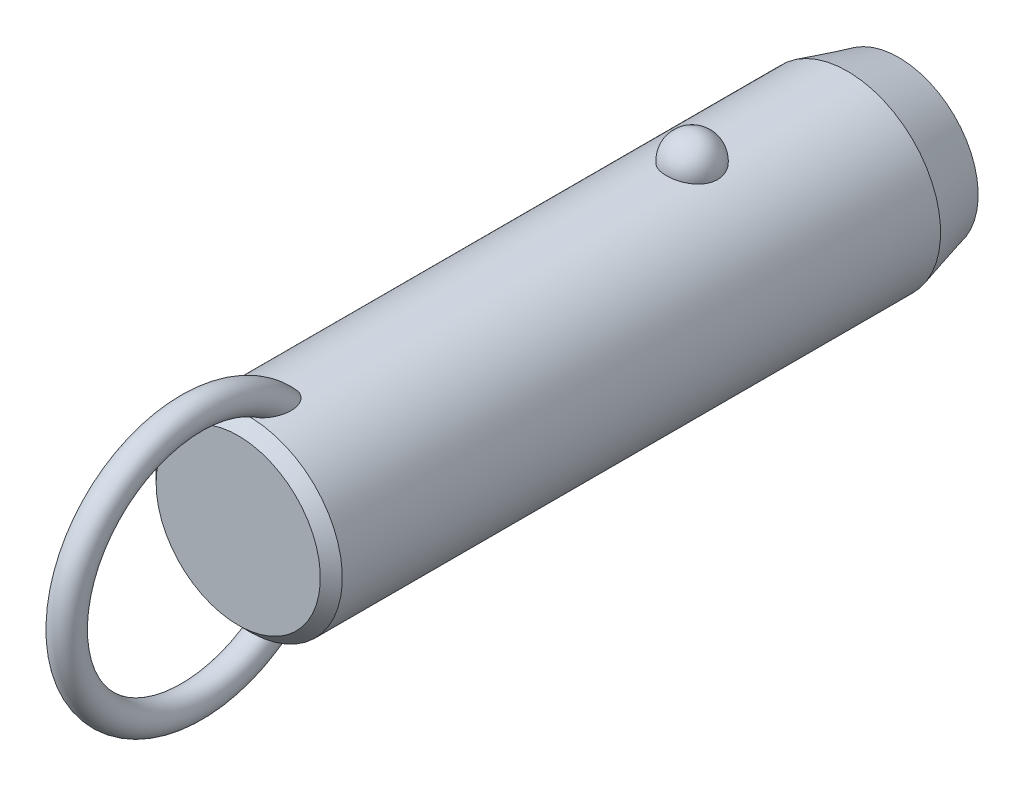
ISO-10303-21;
HEADER;
FILE_DESCRIPTION(('STEP AP214'),'2;1');
FILE_NAME('part.step','',(''),(''),'','','');
FILE_SCHEMA(('AUTOMOTIVE_DESIGN { 1 0 10303 214 1 1 1 1 }'));
ENDSEC;
DATA;
#1=APPLICATION_CONTEXT('core data for automotive mechanical design processes');
#2=APPLICATION_PROTOCOL_DEFINITION('international standard','automotive_design',2000,#1);
#3=PRODUCT_CONTEXT('',#1,'mechanical');
#4=PRODUCT('Part','Part','',(#3));
#5=PRODUCT_RELATED_PRODUCT_CATEGORY('part','',(#4));
#6=PRODUCT_DEFINITION_FORMATION('','',#4);
#7=PRODUCT_DEFINITION_CONTEXT('part definition',#1,'design');
#8=PRODUCT_DEFINITION('design','',#6,#7);
#9=PRODUCT_DEFINITION_SHAPE('','',#8);
#10=(LENGTH_UNIT() NAMED_UNIT(*) SI_UNIT(.MILLI.,.METRE.));
#11=(NAMED_UNIT(*) PLANE_ANGLE_UNIT() SI_UNIT($,.RADIAN.));
#12=(NAMED_UNIT(*) SI_UNIT($,.STERADIAN.) SOLID_ANGLE_UNIT());
#13=UNCERTAINTY_MEASURE_WITH_UNIT(LENGTH_MEASURE(1.E-05),#10,'distance_accuracy_value','');
#14=(GEOMETRIC_REPRESENTATION_CONTEXT(3) GLOBAL_UNCERTAINTY_ASSIGNED_CONTEXT((#13)) GLOBAL_UNIT_ASSIGNED_CONTEXT((#10,
#11,#12)) REPRESENTATION_CONTEXT('',''));
#15=CARTESIAN_POINT('',(0.,0.,0.));
#16=DIRECTION('',(0.,0.,1.));
#17=DIRECTION('',(1.,0.,0.));
#18=AXIS2_PLACEMENT_3D('',#15,#16,#17);
#19=CARTESIAN_POINT('',(0.,0.,45.7));
#20=DIRECTION('',(0.,0.,-1.));
#21=DIRECTION('',(-1.,0.,0.));
#22=AXIS2_PLACEMENT_3D('',#19,#20,#21);
#23=CYLINDRICAL_SURFACE('',#22,12.7);
#24=CARTESIAN_POINT('',(3.46661256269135,12.2177165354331,-3.5));
#25=CARTESIAN_POINT('',(3.4666090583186,12.2177194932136,-3.30432790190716));
#26=CARTESIAN_POINT('',(3.45063567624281,12.2222841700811,-3.10861112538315));
#27=CARTESIAN_POINT('',(3.38712451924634,12.2400345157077,-2.72271899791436));
#28=CARTESIAN_POINT('',(3.33957415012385,12.2532236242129,-2.53254588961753));
#29=CARTESIAN_POINT('',(3.2141234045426,12.286724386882,-2.16324948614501));
#30=CARTESIAN_POINT('',(3.13623639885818,12.3070329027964,-1.98412136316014));
#31=CARTESIAN_POINT('',(2.95205930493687,12.3525018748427,-1.64180592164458));
#32=CARTESIAN_POINT('',(2.84577003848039,12.3776621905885,-1.47861814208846));
#33=CARTESIAN_POINT('',(2.60688050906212,12.4301712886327,-1.17190583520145));
#34=CARTESIAN_POINT('',(2.47415697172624,12.4575299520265,-1.02847897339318));
#35=CARTESIAN_POINT('',(2.18615174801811,12.5112810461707,-0.766177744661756));
#36=CARTESIAN_POINT('',(2.03087002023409,12.5376734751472,-0.647303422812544));
#37=CARTESIAN_POINT('',(1.70237334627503,12.5864761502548,-0.437732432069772));
#38=CARTESIAN_POINT('',(1.52920948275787,12.6088972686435,-0.346958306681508));
#39=CARTESIAN_POINT('',(1.16944170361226,12.6473352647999,-0.195750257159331));
#40=CARTESIAN_POINT('',(0.982839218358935,12.663352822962,-0.135313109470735));
#41=CARTESIAN_POINT('',(0.604961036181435,12.6869706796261,-0.0473241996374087));
#42=CARTESIAN_POINT('',(0.413823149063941,12.6947125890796,-0.0192185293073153));
#43=CARTESIAN_POINT('',(0.0293827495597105,12.7014203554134,0.0051725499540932));
#44=CARTESIAN_POINT('',(-0.163919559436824,12.7003870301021,0.00146092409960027));
#45=CARTESIAN_POINT('',(-0.544374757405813,12.689735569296,-0.0373939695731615));
#46=CARTESIAN_POINT('',(-0.731575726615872,12.6802364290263,-0.0721015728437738));
#47=CARTESIAN_POINT('',(-1.09733277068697,12.6538333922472,-0.171364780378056));
#48=CARTESIAN_POINT('',(-1.27588869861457,12.6369293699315,-0.235920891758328));
#49=CARTESIAN_POINT('',(-1.6204698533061,12.5973946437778,-0.393548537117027));
#50=CARTESIAN_POINT('',(-1.78641865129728,12.5747321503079,-0.486778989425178));
#51=CARTESIAN_POINT('',(-2.10030671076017,12.5261316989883,-0.699110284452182));
#52=CARTESIAN_POINT('',(-2.24824419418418,12.5001934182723,-0.818213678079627));
#53=CARTESIAN_POINT('',(-2.52491489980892,12.4472906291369,-1.08157124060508));
#54=CARTESIAN_POINT('',(-2.65324222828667,12.4203160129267,-1.22624992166));
#55=CARTESIAN_POINT('',(-2.88410007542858,12.3687509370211,-1.53528325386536));
#56=CARTESIAN_POINT('',(-2.98662883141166,12.3441606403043,-1.69963924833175));
#57=CARTESIAN_POINT('',(-3.16432417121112,12.2998199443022,-2.04548497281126));
#58=CARTESIAN_POINT('',(-3.23917525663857,12.2801261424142,-2.22714424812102));
#59=CARTESIAN_POINT('',(-3.35800573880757,12.248167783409,-2.6009138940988));
#60=CARTESIAN_POINT('',(-3.4019860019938,12.2359030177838,-2.79302397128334));
#61=CARTESIAN_POINT('',(-3.45784812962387,12.2202347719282,-3.18140279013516));
#62=CARTESIAN_POINT('',(-3.46986123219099,12.2167950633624,-3.37765118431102));
#63=CARTESIAN_POINT('',(-3.46186273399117,12.2190638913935,-3.76943689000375));
#64=CARTESIAN_POINT('',(-3.44185196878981,12.2247721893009,-3.96497421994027));
#65=CARTESIAN_POINT('',(-3.37048652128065,12.2446381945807,-4.34881728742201));
#66=CARTESIAN_POINT('',(-3.31928253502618,12.2587552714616,-4.53715319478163));
#67=CARTESIAN_POINT('',(-3.18693461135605,12.2938237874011,-4.90231727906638));
#68=CARTESIAN_POINT('',(-3.1057895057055,12.3147754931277,-5.07914500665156));
#69=CARTESIAN_POINT('',(-2.91506431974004,12.3613125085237,-5.4173205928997));
#70=CARTESIAN_POINT('',(-2.80533587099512,12.3869217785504,-5.57858147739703));
#71=CARTESIAN_POINT('',(-2.560414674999,12.4398525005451,-5.88013283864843));
#72=CARTESIAN_POINT('',(-2.42522099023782,12.4671740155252,-6.02042254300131));
#73=CARTESIAN_POINT('',(-2.1323357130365,12.5205965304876,-6.27662798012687));
#74=CARTESIAN_POINT('',(-1.97456596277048,12.5466928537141,-6.39245542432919));
#75=CARTESIAN_POINT('',(-1.64115839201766,12.5946384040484,-6.59583547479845));
#76=CARTESIAN_POINT('',(-1.46552179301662,12.6164879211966,-6.68339001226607));
#77=CARTESIAN_POINT('',(-1.10356050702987,12.6532533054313,-6.82682153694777));
#78=CARTESIAN_POINT('',(-0.917391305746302,12.6682500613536,-6.88306988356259));
#79=CARTESIAN_POINT('',(-0.537836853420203,12.6900288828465,-6.96386887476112));
#80=CARTESIAN_POINT('',(-0.344452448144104,12.6968119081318,-6.98842322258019));
#81=CARTESIAN_POINT('',(0.0402577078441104,12.7013667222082,-7.0049646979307));
#82=CARTESIAN_POINT('',(0.231556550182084,12.6993008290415,-6.99753844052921));
#83=CARTESIAN_POINT('',(0.610105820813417,12.6867505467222,-6.95166366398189));
#84=CARTESIAN_POINT('',(0.797356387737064,12.6762664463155,-6.91321620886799));
#85=CARTESIAN_POINT('',(1.16186657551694,12.6480587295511,-6.80658431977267));
#86=CARTESIAN_POINT('',(1.33915951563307,12.6303611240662,-6.73850666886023));
#87=CARTESIAN_POINT('',(1.67968518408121,12.5896027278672,-6.57450875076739));
#88=CARTESIAN_POINT('',(1.84291705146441,12.5665416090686,-6.47858678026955));
#89=CARTESIAN_POINT('',(2.15340192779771,12.5171072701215,-6.25982455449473));
#90=CARTESIAN_POINT('',(2.30037831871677,12.4906895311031,-6.13660186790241));
#91=CARTESIAN_POINT('',(2.5717412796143,12.4376567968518,-5.86739587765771));
#92=CARTESIAN_POINT('',(2.69612388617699,12.4110417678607,-5.72140858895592));
#93=CARTESIAN_POINT('',(2.92107785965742,12.360051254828,-5.40794137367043));
#94=CARTESIAN_POINT('',(3.02121329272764,12.3357209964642,-5.24014110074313));
#95=CARTESIAN_POINT('',(3.19236291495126,12.2925446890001,-4.8896986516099));
#96=CARTESIAN_POINT('',(3.26338839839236,12.2736965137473,-4.70706226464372));
#97=CARTESIAN_POINT('',(3.36788038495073,12.245404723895,-4.35469510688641));
#98=CARTESIAN_POINT('',(3.40484026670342,12.2351018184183,-4.18605935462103));
#99=CARTESIAN_POINT('',(3.45420764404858,12.2212564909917,-3.84496058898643));
#100=CARTESIAN_POINT('',(3.46661565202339,12.2177139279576,-3.67249765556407));
#101=CARTESIAN_POINT('',(3.46661256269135,12.2177165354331,-3.5));
#102=B_SPLINE_CURVE_WITH_KNOTS('',3,(#24,#25,#26,#27,#28,#29,#30,#31,#32,#33,#34,#35,#36,#37,
#38,#39,#40,#41,#42,#43,#44,#45,#46,#47,#48,#49,#50,#51,#52,#53,#54,#55,#56,#57,#58,#59,#60,#61,
#62,#63,#64,#65,#66,#67,#68,#69,#70,#71,#72,#73,#74,#75,#76,#77,#78,#79,#80,#81,#82,#83,#84,#85,
#86,#87,#88,#89,#90,#91,#92,#93,#94,#95,#96,#97,#98,#99,#100,#101),.UNSPECIFIED.,.T.,.F.,(4,2,2,
2,2,2,2,2,2,2,2,2,2,2,2,2,2,2,2,2,2,2,2,2,2,2,2,2,2,2,2,2,2,2,2,2,2,2,4),(0.,0.586396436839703,
1.17302689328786,1.7593990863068,2.34575431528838,2.93491084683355,3.52406845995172,
4.11158733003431,4.69904375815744,5.2762784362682,5.85345931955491,6.42265312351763,
6.99185659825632,7.56427334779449,8.136746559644,8.71981013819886,9.3029135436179,
9.89247258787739,10.4820150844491,11.0691335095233,11.6562366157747,12.2405256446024,
12.8248374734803,13.412244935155,13.9996740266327,14.5891883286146,15.1786623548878,
15.7609861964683,16.3432419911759,16.914863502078,17.4864654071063,18.0560241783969,
18.6256177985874,19.2037609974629,19.7820055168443,20.3699810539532,20.9577282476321,
21.4746855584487,21.9916320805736),.UNSPECIFIED.);
#103=CARTESIAN_POINT('',(3.46661256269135,12.2177165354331,-3.5));
#104=VERTEX_POINT('',#103);
#105=EDGE_CURVE('E41',#104,#104,#102,.T.);
#106=ORIENTED_EDGE('',*,*,#105,.T.);
#107=EDGE_LOOP('',(#106));
#108=FACE_BOUND('',#107,.T.);
#109=CARTESIAN_POINT('',(0.,0.,56.9000000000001));
#110=DIRECTION('',(0.,0.,1.));
#111=DIRECTION('',(1.,0.,0.));
#112=AXIS2_PLACEMENT_3D('',#109,#110,#111);
#113=CIRCLE('',#112,12.7);
#114=CARTESIAN_POINT('',(-12.7,0.,56.9000000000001));
#115=VERTEX_POINT('',#114);
#116=EDGE_CURVE('E10',#115,#115,#113,.F.);
#117=ORIENTED_EDGE('',*,*,#116,.T.);
#118=EDGE_LOOP('',(#117));
#119=FACE_BOUND('',#118,.T.);
#120=CARTESIAN_POINT('',(-0.548122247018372,-12.6881662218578,50.6432187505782));
#121=CARTESIAN_POINT('',(-0.648865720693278,-12.6838128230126,50.677926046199));
#122=CARTESIAN_POINT('',(-0.746398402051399,-12.6783867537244,50.7220428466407));
#123=CARTESIAN_POINT('',(-0.932125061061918,-12.666091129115,50.8267647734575));
#124=CARTESIAN_POINT('',(-1.02030388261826,-12.6592192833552,50.8873961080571));
#125=CARTESIAN_POINT('',(-1.18487740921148,-12.6448747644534,51.021847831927));
#126=CARTESIAN_POINT('',(-1.26134296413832,-12.637406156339,51.0955825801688));
#127=CARTESIAN_POINT('',(-1.4023120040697,-12.6225412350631,51.2536045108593));
#128=CARTESIAN_POINT('',(-1.46681470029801,-12.6151449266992,51.3378923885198));
#129=CARTESIAN_POINT('',(-1.60714786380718,-12.5981718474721,51.5496577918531));
#130=CARTESIAN_POINT('',(-1.67725126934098,-12.588900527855,51.680962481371));
#131=CARTESIAN_POINT('',(-1.79536591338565,-12.5725964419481,51.9532471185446));
#132=CARTESIAN_POINT('',(-1.84333535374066,-12.5655679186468,52.0942447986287));
#133=CARTESIAN_POINT('',(-1.93422576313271,-12.5519624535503,52.4376455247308));
#134=CARTESIAN_POINT('',(-1.96788773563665,-12.5466298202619,52.6425578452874));
#135=CARTESIAN_POINT('',(-1.9941399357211,-12.542463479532,52.9517600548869));
#136=CARTESIAN_POINT('',(-1.99883864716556,-12.5417153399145,53.0552987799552));
#137=CARTESIAN_POINT('',(-2.00078003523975,-12.5414074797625,53.2624512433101));
#138=CARTESIAN_POINT('',(-1.99802449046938,-12.5418474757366,53.3660649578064));
#139=CARTESIAN_POINT('',(-1.98336733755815,-12.5441750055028,53.6103207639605));
#140=CARTESIAN_POINT('',(-1.96851430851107,-12.5465291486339,53.7507804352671));
#141=CARTESIAN_POINT('',(-1.92707089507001,-12.5529612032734,54.0299607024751));
#142=CARTESIAN_POINT('',(-1.90047458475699,-12.5570399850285,54.1686803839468));
#143=CARTESIAN_POINT('',(-1.83619120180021,-12.5666008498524,54.4434113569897));
#144=CARTESIAN_POINT('',(-1.79850828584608,-12.57208240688,54.5794236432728));
#145=CARTESIAN_POINT('',(-1.71223796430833,-12.5841228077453,54.8478421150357));
#146=CARTESIAN_POINT('',(-1.66365679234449,-12.5906810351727,54.9802503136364));
#147=CARTESIAN_POINT('',(-1.57804503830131,-12.6016176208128,55.1854887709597));
#148=CARTESIAN_POINT('',(-1.54477252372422,-12.6057501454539,55.2599149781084));
#149=CARTESIAN_POINT('',(-1.47424480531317,-12.6141930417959,55.4068393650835));
#150=CARTESIAN_POINT('',(-1.43699041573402,-12.6185033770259,55.4793379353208));
#151=CARTESIAN_POINT('',(-1.35825795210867,-12.6272207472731,55.6218926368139));
#152=CARTESIAN_POINT('',(-1.31678520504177,-12.6316276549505,55.6919517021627));
#153=CARTESIAN_POINT('',(-1.22917793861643,-12.6404532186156,55.8290705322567));
#154=CARTESIAN_POINT('',(-1.18304514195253,-12.6448718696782,55.8961313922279));
#155=CARTESIAN_POINT('',(-1.0724641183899,-12.6547893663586,56.0438741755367));
#156=CARTESIAN_POINT('',(-1.00642239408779,-12.6602600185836,56.1233844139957));
#157=CARTESIAN_POINT('',(-0.86444142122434,-12.6707460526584,56.2731698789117));
#158=CARTESIAN_POINT('',(-0.788516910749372,-12.6757620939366,56.3434585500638));
#159=CARTESIAN_POINT('',(-0.652215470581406,-12.6833591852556,56.4486801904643));
#160=CARTESIAN_POINT('',(-0.594982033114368,-12.6861973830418,56.4876241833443));
#161=CARTESIAN_POINT('',(-0.475269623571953,-12.6912445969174,56.5564899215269));
#162=CARTESIAN_POINT('',(-0.412800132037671,-12.6934547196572,56.5864275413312));
#163=CARTESIAN_POINT('',(-0.29574972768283,-12.6966636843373,56.6297565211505));
#164=CARTESIAN_POINT('',(-0.241949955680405,-12.6978134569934,56.6452188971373));
#165=CARTESIAN_POINT('',(-0.132508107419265,-12.6994261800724,56.6668845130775));
#166=CARTESIAN_POINT('',(-0.0768679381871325,-12.6998898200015,56.6730970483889));
#167=CARTESIAN_POINT('',(0.0347696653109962,-12.7000752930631,56.6755838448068));
#168=CARTESIAN_POINT('',(0.0907676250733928,-12.6997954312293,56.6718353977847));
#169=CARTESIAN_POINT('',(0.201283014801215,-12.6985255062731,56.6547883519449));
#170=CARTESIAN_POINT('',(0.255799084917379,-12.6975348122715,56.6414812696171));
#171=CARTESIAN_POINT('',(0.376042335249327,-12.6946091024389,56.6020379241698));
#172=CARTESIAN_POINT('',(0.440950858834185,-12.6924943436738,56.5734492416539));
#173=CARTESIAN_POINT('',(0.565350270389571,-12.6875639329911,56.5063234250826));
#174=CARTESIAN_POINT('',(0.624828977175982,-12.6847467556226,56.4677646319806));
#175=CARTESIAN_POINT('',(0.774116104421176,-12.6767252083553,56.356949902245));
#176=CARTESIAN_POINT('',(0.859449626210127,-12.6711344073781,56.2787605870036));
#177=CARTESIAN_POINT('',(1.01789440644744,-12.6593922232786,56.110943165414));
#178=CARTESIAN_POINT('',(1.09096902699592,-12.653239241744,56.021282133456));
#179=CARTESIAN_POINT('',(1.22268793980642,-12.6411674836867,55.8402658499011));
#180=CARTESIAN_POINT('',(1.28193986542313,-12.6352572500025,55.749345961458));
#181=CARTESIAN_POINT('',(1.39259777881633,-12.6235401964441,55.5627929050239));
#182=CARTESIAN_POINT('',(1.44399707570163,-12.6177334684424,55.4671558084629));
#183=CARTESIAN_POINT('',(1.53972870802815,-12.6064093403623,55.2722738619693));
#184=CARTESIAN_POINT('',(1.58405262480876,-12.6008922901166,55.1730248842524));
#185=CARTESIAN_POINT('',(1.66600705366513,-12.5903187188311,54.9717727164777));
#186=CARTESIAN_POINT('',(1.70363651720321,-12.5852622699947,54.8697690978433));
#187=CARTESIAN_POINT('',(1.77545379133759,-12.5753406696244,54.6543580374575));
#188=CARTESIAN_POINT('',(1.80903453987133,-12.5705328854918,54.540745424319));
#189=CARTESIAN_POINT('',(1.86844163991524,-12.5618400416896,54.3114575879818));
#190=CARTESIAN_POINT('',(1.89426665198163,-12.5579551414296,54.1957820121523));
#191=CARTESIAN_POINT('',(1.9378546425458,-12.5513030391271,53.9630072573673));
#192=CARTESIAN_POINT('',(1.9556264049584,-12.5485346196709,53.8459097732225));
#193=CARTESIAN_POINT('',(1.98264463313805,-12.5442934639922,53.6107473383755));
#194=CARTESIAN_POINT('',(1.99189298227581,-12.5428204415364,53.4926826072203));
#195=CARTESIAN_POINT('',(2.00416068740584,-12.540871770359,53.1806225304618));
#196=CARTESIAN_POINT('',(1.99944433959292,-12.541631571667,52.9862290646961));
#197=CARTESIAN_POINT('',(1.96113755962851,-12.5476846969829,52.6003095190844));
#198=CARTESIAN_POINT('',(1.92758341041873,-12.5529723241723,52.4087801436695));
#199=CARTESIAN_POINT('',(1.8393434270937,-12.5661532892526,52.0822728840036));
#200=CARTESIAN_POINT('',(1.79215440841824,-12.5730485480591,51.9452499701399));
#201=CARTESIAN_POINT('',(1.67676242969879,-12.588958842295,51.6804459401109));
#202=CARTESIAN_POINT('',(1.60859050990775,-12.597970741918,51.5526515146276));
#203=CARTESIAN_POINT('',(1.46583832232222,-12.6152829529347,51.3358006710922));
#204=CARTESIAN_POINT('',(1.39525727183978,-12.6233659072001,51.2441050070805));
#205=CARTESIAN_POINT('',(1.23992594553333,-12.6395676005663,51.0734854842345));
#206=CARTESIAN_POINT('',(1.15517932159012,-12.6476863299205,50.9945583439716));
#207=CARTESIAN_POINT('',(0.971995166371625,-12.6630846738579,50.8526438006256));
#208=CARTESIAN_POINT('',(0.873456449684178,-12.6703572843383,50.7897849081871));
#209=CARTESIAN_POINT('',(0.665847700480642,-12.6829569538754,50.6844870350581));
#210=CARTESIAN_POINT('',(0.556784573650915,-12.688285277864,50.6420347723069));
#211=CARTESIAN_POINT('',(0.347338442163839,-12.6956226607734,50.5844434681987));
#212=CARTESIAN_POINT('',(0.247759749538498,-12.6979816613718,50.5663996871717));
#213=CARTESIAN_POINT('',(0.0470218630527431,-12.7003077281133,50.5486007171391));
#214=CARTESIAN_POINT('',(-0.0541350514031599,-12.7002779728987,50.5488212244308));
#215=CARTESIAN_POINT('',(-0.221414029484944,-12.6982482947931,50.5643639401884));
#216=CARTESIAN_POINT('',(-0.288055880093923,-12.6969033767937,50.5746662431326));
#217=CARTESIAN_POINT('',(-0.419599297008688,-12.6932369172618,50.6031348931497));
#218=CARTESIAN_POINT('',(-0.484501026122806,-12.6909154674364,50.6213005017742));
#219=CARTESIAN_POINT('',(-0.548122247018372,-12.6881662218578,50.6432187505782));
#220=B_SPLINE_CURVE_WITH_KNOTS('',3,(#120,#121,#122,#123,#124,#125,#126,#127,#128,#129,#130,
#131,#132,#133,#134,#135,#136,#137,#138,#139,#140,#141,#142,#143,#144,#145,#146,#147,#148,#149,
#150,#151,#152,#153,#154,#155,#156,#157,#158,#159,#160,#161,#162,#163,#164,#165,#166,#167,#168,
#169,#170,#171,#172,#173,#174,#175,#176,#177,#178,#179,#180,#181,#182,#183,#184,#185,#186,#187,
#188,#189,#190,#191,#192,#193,#194,#195,#196,#197,#198,#199,#200,#201,#202,#203,#204,#205,#206,
#207,#208,#209,#210,#211,#212,#213,#214,#215,#216,#217,#218,#219),.UNSPECIFIED.,.T.,.F.,(4,2,2,
2,2,2,2,2,2,2,2,2,2,2,2,2,2,2,2,2,2,2,2,2,2,2,2,2,2,2,2,2,2,2,2,2,2,2,2,2,2,2,2,2,2,2,2,2,2,4),
(0.,0.319642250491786,0.63979475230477,0.957927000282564,1.27608021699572,1.72100165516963,
2.16675988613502,2.78630021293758,3.09705782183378,3.40774128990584,3.83096358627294,
4.2543996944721,4.67767724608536,5.10071330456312,5.34550297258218,5.59024267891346,
5.83467707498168,6.07902143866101,6.38891080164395,6.69834321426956,6.90560910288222,
7.11250749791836,7.27977315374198,7.44687060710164,7.61434932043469,7.78197685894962,
7.99365544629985,8.20579780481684,8.55147335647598,8.8981642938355,9.22375138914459,
9.54961437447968,9.8758622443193,10.202161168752,10.557587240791,10.9130746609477,
11.2681734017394,11.6231936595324,12.2046601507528,12.7853961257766,13.219164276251,
13.6522938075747,13.9989174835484,14.3454519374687,14.6946768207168,15.0436740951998,
15.3457513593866,15.6474266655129,15.8493051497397,16.0511646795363),.UNSPECIFIED.);
#221=CARTESIAN_POINT('',(-0.548122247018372,-12.6881662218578,50.6432187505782));
#222=VERTEX_POINT('',#221);
#223=EDGE_CURVE('E59',#222,#222,#220,.T.);
#224=ORIENTED_EDGE('',*,*,#223,.T.);
#225=EDGE_LOOP('',(#224));
#226=FACE_BOUND('',#225,.T.);
#227=CARTESIAN_POINT('',(-0.548122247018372,12.6881662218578,50.6432187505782));
#228=CARTESIAN_POINT('',(-0.459436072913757,12.6919968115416,50.612673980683));
#229=CARTESIAN_POINT('',(-0.368189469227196,12.6949996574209,50.5893913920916));
#230=CARTESIAN_POINT('',(-0.183024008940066,12.6990186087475,50.5584062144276));
#231=CARTESIAN_POINT('',(-0.089104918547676,12.7000345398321,50.5507049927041));
#232=CARTESIAN_POINT('',(0.0987147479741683,12.6999636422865,50.5512455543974));
#233=CARTESIAN_POINT('',(0.192615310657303,12.6988761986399,50.5594920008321));
#234=CARTESIAN_POINT('',(0.377658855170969,12.6947211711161,50.5915515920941));
#235=CARTESIAN_POINT('',(0.46880177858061,12.6916535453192,50.6153650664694));
#236=CARTESIAN_POINT('',(0.645809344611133,12.6838788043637,50.6774565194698));
#237=CARTESIAN_POINT('',(0.731679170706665,12.6791733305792,50.715720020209));
#238=CARTESIAN_POINT('',(0.896315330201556,12.6686004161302,50.805120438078));
#239=CARTESIAN_POINT('',(0.975080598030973,12.6627328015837,50.8562592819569));
#240=CARTESIAN_POINT('',(1.12963655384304,12.6499161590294,50.9736782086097));
#241=CARTESIAN_POINT('',(1.20478673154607,12.6429194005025,51.0407929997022));
#242=CARTESIAN_POINT('',(1.34448241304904,12.6288282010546,51.1852250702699));
#243=CARTESIAN_POINT('',(1.40902173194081,12.621733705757,51.2625482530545));
#244=CARTESIAN_POINT('',(1.55208211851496,12.6050877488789,51.4592475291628));
#245=CARTESIAN_POINT('',(1.62510490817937,12.5957546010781,51.5826540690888));
#246=CARTESIAN_POINT('',(1.7501904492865,12.5789823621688,51.8397690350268));
#247=CARTESIAN_POINT('',(1.80221377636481,12.5715468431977,51.973496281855));
#248=CARTESIAN_POINT('',(1.90309965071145,12.5567434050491,52.2983516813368));
#249=CARTESIAN_POINT('',(1.94342317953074,12.5504515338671,52.4921611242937));
#250=CARTESIAN_POINT('',(1.99332997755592,12.5426147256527,52.8837881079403));
#251=CARTESIAN_POINT('',(2.00285305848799,12.5410790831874,53.0816127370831));
#252=CARTESIAN_POINT('',(1.99678999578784,12.5420407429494,53.4166427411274));
#253=CARTESIAN_POINT('',(1.98794117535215,12.5434564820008,53.5540428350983));
#254=CARTESIAN_POINT('',(1.95865119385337,12.5480641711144,53.8276394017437));
#255=CARTESIAN_POINT('',(1.93820436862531,12.5512569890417,53.9638352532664));
#256=CARTESIAN_POINT('',(1.88647896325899,12.5591352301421,54.2342493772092));
#257=CARTESIAN_POINT('',(1.85518800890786,12.5638223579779,54.3684652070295));
#258=CARTESIAN_POINT('',(1.78217886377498,12.5743868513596,54.6339362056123));
#259=CARTESIAN_POINT('',(1.74046509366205,12.5802637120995,54.7651926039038));
#260=CARTESIAN_POINT('',(1.66024095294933,12.5910571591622,54.9860855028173));
#261=CARTESIAN_POINT('',(1.62434772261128,12.5957535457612,55.0766904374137));
#262=CARTESIAN_POINT('',(1.54709009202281,12.6054762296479,55.2555125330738));
#263=CARTESIAN_POINT('',(1.50572681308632,12.6105024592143,55.3437301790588));
#264=CARTESIAN_POINT('',(1.41728020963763,12.620748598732,55.5169321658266));
#265=CARTESIAN_POINT('',(1.37021377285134,12.625967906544,55.6019251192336));
#266=CARTESIAN_POINT('',(1.26969620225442,12.6364721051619,55.7680072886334));
#267=CARTESIAN_POINT('',(1.21624929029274,12.6417569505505,55.8490990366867));
#268=CARTESIAN_POINT('',(1.10304413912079,12.6521331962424,56.0047027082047));
#269=CARTESIAN_POINT('',(1.04340936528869,12.657226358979,56.0793033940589));
#270=CARTESIAN_POINT('',(0.915919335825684,12.6670906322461,56.221324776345));
#271=CARTESIAN_POINT('',(0.848064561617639,12.6718617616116,56.2887458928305));
#272=CARTESIAN_POINT('',(0.717035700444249,12.67987711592,56.4006247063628));
#273=CARTESIAN_POINT('',(0.655526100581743,12.6832377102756,56.4469970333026));
#274=CARTESIAN_POINT('',(0.525985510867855,12.6892676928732,56.5296195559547));
#275=CARTESIAN_POINT('',(0.457969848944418,12.6919386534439,56.5658927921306));
#276=CARTESIAN_POINT('',(0.334859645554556,12.695691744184,56.6166572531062));
#277=CARTESIAN_POINT('',(0.281116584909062,12.6970073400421,56.6343733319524));
#278=CARTESIAN_POINT('',(0.171425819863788,12.6989609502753,56.6606429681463));
#279=CARTESIAN_POINT('',(0.115480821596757,12.699599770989,56.6692074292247));
#280=CARTESIAN_POINT('',(0.00272618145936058,12.7001251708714,56.6762531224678));
#281=CARTESIAN_POINT('',(-0.0540859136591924,12.7000089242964,56.6746964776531));
#282=CARTESIAN_POINT('',(-0.166544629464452,12.6990328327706,56.6616005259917));
#283=CARTESIAN_POINT('',(-0.222190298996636,12.6981724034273,56.6500533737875));
#284=CARTESIAN_POINT('',(-0.342018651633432,12.695562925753,56.6149128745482));
#285=CARTESIAN_POINT('',(-0.405606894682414,12.6936676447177,56.5893322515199));
#286=CARTESIAN_POINT('',(-0.527815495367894,12.6891754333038,56.5283111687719));
#287=CARTESIAN_POINT('',(-0.586425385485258,12.6865770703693,56.4928505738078));
#288=CARTESIAN_POINT('',(-0.731842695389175,12.6792129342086,56.3914960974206));
#289=CARTESIAN_POINT('',(-0.814709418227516,12.6740767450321,56.3200395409));
#290=CARTESIAN_POINT('',(-0.969101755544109,12.6632083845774,56.1658900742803));
#291=CARTESIAN_POINT('',(-1.04059564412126,12.6574746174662,56.0831668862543));
#292=CARTESIAN_POINT('',(-1.1698111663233,12.6461638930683,55.9158096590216));
#293=CARTESIAN_POINT('',(-1.22811369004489,12.6405994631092,55.8316166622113));
#294=CARTESIAN_POINT('',(-1.33743405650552,12.6295007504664,55.6585791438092));
#295=CARTESIAN_POINT('',(-1.38844577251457,12.6239664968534,55.5697307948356));
#296=CARTESIAN_POINT('',(-1.48400702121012,12.6130898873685,55.388389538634));
#297=CARTESIAN_POINT('',(-1.52854232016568,12.6077479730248,55.2958891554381));
#298=CARTESIAN_POINT('',(-1.61150113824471,12.5974127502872,55.1081607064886));
#299=CARTESIAN_POINT('',(-1.64992317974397,12.5924195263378,55.0129319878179));
#300=CARTESIAN_POINT('',(-1.73468589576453,12.581070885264,54.7828936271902));
#301=CARTESIAN_POINT('',(-1.77831261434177,12.5749388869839,54.6470661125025));
#302=CARTESIAN_POINT('',(-1.85439734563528,12.5639437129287,54.3722128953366));
#303=CARTESIAN_POINT('',(-1.88684994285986,12.5590811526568,54.2331856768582));
#304=CARTESIAN_POINT('',(-1.9400848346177,12.550968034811,53.9530923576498));
#305=CARTESIAN_POINT('',(-1.96088706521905,12.5477147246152,53.8120301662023));
#306=CARTESIAN_POINT('',(-1.99000539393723,12.5431291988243,53.5286689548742));
#307=CARTESIAN_POINT('',(-1.99832911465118,12.5417958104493,53.3863707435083));
#308=CARTESIAN_POINT('',(-2.00166624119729,12.5412674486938,53.0576271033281));
#309=CARTESIAN_POINT('',(-1.99178843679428,12.5428579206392,52.871088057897));
#310=CARTESIAN_POINT('',(-1.9445518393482,12.5502731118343,52.5016240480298));
#311=CARTESIAN_POINT('',(-1.90724032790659,12.5560905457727,52.3186934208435));
#312=CARTESIAN_POINT('',(-1.81330718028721,12.5699462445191,52.0048488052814));
#313=CARTESIAN_POINT('',(-1.76338820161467,12.5771273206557,51.8719105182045));
#314=CARTESIAN_POINT('',(-1.64305018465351,12.593414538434,51.6156813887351));
#315=CARTESIAN_POINT('',(-1.57265346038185,12.6025185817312,51.492380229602));
#316=CARTESIAN_POINT('',(-1.42634956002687,12.6198178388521,51.2835648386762));
#317=CARTESIAN_POINT('',(-1.35423772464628,12.6278405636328,51.1953846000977));
#318=CARTESIAN_POINT('',(-1.19645664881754,12.6437632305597,51.0321079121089));
#319=CARTESIAN_POINT('',(-1.11080536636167,12.6516633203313,50.9569944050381));
#320=CARTESIAN_POINT('',(-0.947219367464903,12.6648319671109,50.8378114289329));
#321=CARTESIAN_POINT('',(-0.871624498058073,12.670300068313,50.7905414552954));
#322=CARTESIAN_POINT('',(-0.714161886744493,12.6801492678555,50.7077413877));
#323=CARTESIAN_POINT('',(-0.632295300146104,12.684530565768,50.6722091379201));
#324=CARTESIAN_POINT('',(-0.548122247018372,12.6881662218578,50.6432187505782));
#325=B_SPLINE_CURVE_WITH_KNOTS('',3,(#227,#228,#229,#230,#231,#232,#233,#234,#235,#236,#237,
#238,#239,#240,#241,#242,#243,#244,#245,#246,#247,#248,#249,#250,#251,#252,#253,#254,#255,#256,
#257,#258,#259,#260,#261,#262,#263,#264,#265,#266,#267,#268,#269,#270,#271,#272,#273,#274,#275,
#276,#277,#278,#279,#280,#281,#282,#283,#284,#285,#286,#287,#288,#289,#290,#291,#292,#293,#294,
#295,#296,#297,#298,#299,#300,#301,#302,#303,#304,#305,#306,#307,#308,#309,#310,#311,#312,#313,
#314,#315,#316,#317,#318,#319,#320,#321,#322,#323,#324),.UNSPECIFIED.,.T.,.F.,(4,2,2,2,2,2,2,2,
2,2,2,2,2,2,2,2,2,2,2,2,2,2,2,2,2,2,2,2,2,2,2,2,2,2,2,2,2,2,2,2,2,2,2,2,2,2,2,2,4),(0.,
0.281328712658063,0.56268211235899,0.844117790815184,1.12555942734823,1.40671982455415,
1.68792232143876,1.98972294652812,2.2916988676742,2.72039860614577,3.14989948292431,
3.74084916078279,4.3329529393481,4.74554109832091,5.15833092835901,5.57159335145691,
5.98468079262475,6.27722775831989,6.56971484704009,6.86135609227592,7.15280542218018,
7.43927407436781,7.7257259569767,7.9563586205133,8.18646071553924,8.35559393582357,
8.52452541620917,8.69408946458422,8.86378678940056,9.06834348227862,9.27332014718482,
9.60010414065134,9.92778432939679,10.2350252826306,10.5425229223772,10.8506864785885,
11.1589244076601,11.5867893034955,12.0148612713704,12.4421984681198,12.8692745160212,
13.4279365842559,13.9856380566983,14.4107062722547,14.8353130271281,15.1765567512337,
15.5173516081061,15.7844129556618,16.051425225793),.UNSPECIFIED.);
#326=CARTESIAN_POINT('',(-0.548122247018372,12.6881662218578,50.6432187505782));
#327=VERTEX_POINT('',#326);
#328=EDGE_CURVE('E67',#327,#327,#325,.T.);
#329=ORIENTED_EDGE('',*,*,#328,.T.);
#330=EDGE_LOOP('',(#329));
#331=FACE_BOUND('',#330,.T.);
#332=CARTESIAN_POINT('',(0.,0.,-24.7000000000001));
#333=DIRECTION('',(0.,0.,-1.));
#334=DIRECTION('',(-1.,0.,0.));
#335=AXIS2_PLACEMENT_3D('',#332,#333,#334);
#336=CIRCLE('',#335,12.7);
#337=CARTESIAN_POINT('',(-12.7,0.,-24.7000000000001));
#338=VERTEX_POINT('',#337);
#339=EDGE_CURVE('E56',#338,#338,#336,.F.);
#340=ORIENTED_EDGE('',*,*,#339,.T.);
#341=EDGE_LOOP('',(#340));
#342=FACE_BOUND('',#341,.T.);
#343=ADVANCED_FACE('F37',(#108,#119,#226,#331,#342),#23,.T.);
#344=CARTESIAN_POINT('',(0.,0.,-31.7));
#345=DIRECTION('',(0.,0.,-1.));
#346=DIRECTION('',(-1.,0.,0.));
#347=AXIS2_PLACEMENT_3D('',#344,#345,#346);
#348=PLANE('',#347);
#349=CARTESIAN_POINT('',(0.,0.,-31.7));
#350=DIRECTION('',(0.,0.,-1.));
#351=DIRECTION('',(-1.,0.,0.));
#352=AXIS2_PLACEMENT_3D('',#349,#350,#351);
#353=CIRCLE('',#352,10.8243556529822);
#354=CARTESIAN_POINT('',(-10.8243556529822,0.,-31.7));
#355=VERTEX_POINT('',#354);
#356=EDGE_CURVE('E66',#355,#355,#353,.T.);
#357=ORIENTED_EDGE('',*,*,#356,.T.);
#358=EDGE_LOOP('',(#357));
#359=FACE_BOUND('',#358,.T.);
#360=ADVANCED_FACE('F85',(#359),#348,.T.);
#361=CARTESIAN_POINT('',(0.,0.,-31.7));
#362=DIRECTION('',(0.,0.,1.));
#363=DIRECTION('',(1.,0.,0.));
#364=AXIS2_PLACEMENT_3D('',#361,#362,#363);
#365=CONICAL_SURFACE('',#364,10.8243556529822,0.261799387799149);
#366=ORIENTED_EDGE('',*,*,#339,.F.);
#367=EDGE_LOOP('',(#366));
#368=FACE_BOUND('',#367,.T.);
#369=ORIENTED_EDGE('',*,*,#356,.F.);
#370=EDGE_LOOP('',(#369));
#371=FACE_BOUND('',#370,.T.);
#372=ADVANCED_FACE('F83',(#368,#371),#365,.T.);
#373=CARTESIAN_POINT('',(0.,0.,58.4));
#374=DIRECTION('',(0.,0.,1.));
#375=DIRECTION('',(1.,0.,0.));
#376=AXIS2_PLACEMENT_3D('',#373,#374,#375);
#377=PLANE('',#376);
#378=CARTESIAN_POINT('',(0.,0.,58.4));
#379=DIRECTION('',(0.,0.,1.));
#380=DIRECTION('',(1.,0.,0.));
#381=AXIS2_PLACEMENT_3D('',#378,#379,#380);
#382=CIRCLE('',#381,11.2000000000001);
#383=CARTESIAN_POINT('',(-11.2000000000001,0.,58.4));
#384=VERTEX_POINT('',#383);
#385=EDGE_CURVE('E50',#384,#384,#382,.T.);
#386=ORIENTED_EDGE('',*,*,#385,.T.);
#387=EDGE_LOOP('',(#386));
#388=FACE_BOUND('',#387,.T.);
#389=ADVANCED_FACE('F77',(#388),#377,.T.);
#390=CARTESIAN_POINT('',(0.,0.,64.75));
#391=DIRECTION('',(1.,0.,0.));
#392=DIRECTION('',(0.,0.,-1.));
#393=AXIS2_PLACEMENT_3D('',#390,#391,#392);
#394=TOROIDAL_SURFACE('',#393,17.05,2.);
#395=ORIENTED_EDGE('',*,*,#328,.F.);
#396=EDGE_LOOP('',(#395));
#397=FACE_BOUND('',#396,.T.);
#398=ORIENTED_EDGE('',*,*,#223,.F.);
#399=EDGE_LOOP('',(#398));
#400=FACE_BOUND('',#399,.T.);
#401=ADVANCED_FACE('F73',(#397,#400),#394,.T.);
#402=CARTESIAN_POINT('',(0.,0.,58.4));
#403=DIRECTION('',(0.,0.,-1.));
#404=DIRECTION('',(-1.,0.,0.));
#405=AXIS2_PLACEMENT_3D('',#402,#403,#404);
#406=CONICAL_SURFACE('',#405,11.2000000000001,0.785398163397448);
#407=CARTESIAN_POINT('',(-12.7,0.,56.9000000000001));
#408=CARTESIAN_POINT('',(-12.684375,0.,56.9156250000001));
#409=CARTESIAN_POINT('',(-12.66875,0.,56.9312500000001));
#410=CARTESIAN_POINT('',(-12.6375,0.,56.9625000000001));
#411=CARTESIAN_POINT('',(-12.621875,0.,56.9781250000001));
#412=CARTESIAN_POINT('',(-12.590625,0.,57.0093750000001));
#413=CARTESIAN_POINT('',(-12.575,0.,57.0250000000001));
#414=CARTESIAN_POINT('',(-12.54375,0.,57.0562500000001));
#415=CARTESIAN_POINT('',(-12.528125,0.,57.0718750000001));
#416=CARTESIAN_POINT('',(-12.496875,0.,57.1031250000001));
#417=CARTESIAN_POINT('',(-12.48125,0.,57.1187500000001));
#418=CARTESIAN_POINT('',(-12.45,0.,57.1500000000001));
#419=CARTESIAN_POINT('',(-12.434375,0.,57.1656250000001));
#420=CARTESIAN_POINT('',(-12.403125,0.,57.1968750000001));
#421=CARTESIAN_POINT('',(-12.3875,0.,57.2125000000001));
#422=CARTESIAN_POINT('',(-12.35625,0.,57.2437500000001));
#423=CARTESIAN_POINT('',(-12.340625,0.,57.2593750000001));
#424=CARTESIAN_POINT('',(-12.309375,0.,57.2906250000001));
#425=CARTESIAN_POINT('',(-12.29375,0.,57.30625));
#426=CARTESIAN_POINT('',(-12.2625,0.,57.3375));
#427=CARTESIAN_POINT('',(-12.246875,0.,57.3531250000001));
#428=CARTESIAN_POINT('',(-12.215625,0.,57.384375));
#429=CARTESIAN_POINT('',(-12.2,0.,57.4));
#430=CARTESIAN_POINT('',(-12.16875,0.,57.43125));
#431=CARTESIAN_POINT('',(-12.153125,0.,57.446875));
#432=CARTESIAN_POINT('',(-12.121875,0.,57.478125));
#433=CARTESIAN_POINT('',(-12.10625,0.,57.49375));
#434=CARTESIAN_POINT('',(-12.075,0.,57.525));
#435=CARTESIAN_POINT('',(-12.059375,0.,57.540625));
#436=CARTESIAN_POINT('',(-12.028125,0.,57.571875));
#437=CARTESIAN_POINT('',(-12.0125,0.,57.5875));
#438=CARTESIAN_POINT('',(-11.98125,0.,57.61875));
#439=CARTESIAN_POINT('',(-11.965625,0.,57.634375));
#440=CARTESIAN_POINT('',(-11.934375,0.,57.665625));
#441=CARTESIAN_POINT('',(-11.91875,0.,57.68125));
#442=CARTESIAN_POINT('',(-11.8875,0.,57.7125));
#443=CARTESIAN_POINT('',(-11.871875,0.,57.728125));
#444=CARTESIAN_POINT('',(-11.840625,0.,57.759375));
#445=CARTESIAN_POINT('',(-11.825,0.,57.775));
#446=CARTESIAN_POINT('',(-11.79375,0.,57.80625));
#447=CARTESIAN_POINT('',(-11.778125,0.,57.821875));
#448=CARTESIAN_POINT('',(-11.746875,0.,57.853125));
#449=CARTESIAN_POINT('',(-11.73125,0.,57.86875));
#450=CARTESIAN_POINT('',(-11.7000000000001,0.,57.9));
#451=CARTESIAN_POINT('',(-11.684375,0.,57.915625));
#452=CARTESIAN_POINT('',(-11.6531250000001,0.,57.946875));
#453=CARTESIAN_POINT('',(-11.6375000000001,0.,57.9625));
#454=CARTESIAN_POINT('',(-11.6062500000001,0.,57.99375));
#455=CARTESIAN_POINT('',(-11.5906250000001,0.,58.009375));
#456=CARTESIAN_POINT('',(-11.5593750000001,0.,58.040625));
#457=CARTESIAN_POINT('',(-11.5437500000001,0.,58.05625));
#458=CARTESIAN_POINT('',(-11.5125000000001,0.,58.0875));
#459=CARTESIAN_POINT('',(-11.4968750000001,0.,58.103125));
#460=CARTESIAN_POINT('',(-11.4656250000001,0.,58.134375));
#461=CARTESIAN_POINT('',(-11.4500000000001,0.,58.15));
#462=CARTESIAN_POINT('',(-11.4187500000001,0.,58.18125));
#463=CARTESIAN_POINT('',(-11.4031250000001,0.,58.196875));
#464=CARTESIAN_POINT('',(-11.3718750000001,0.,58.228125));
#465=CARTESIAN_POINT('',(-11.3562500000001,0.,58.24375));
#466=CARTESIAN_POINT('',(-11.3250000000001,0.,58.275));
#467=CARTESIAN_POINT('',(-11.3093750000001,0.,58.290625));
#468=CARTESIAN_POINT('',(-11.2781250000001,0.,58.321875));
#469=CARTESIAN_POINT('',(-11.2625000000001,0.,58.3375));
#470=CARTESIAN_POINT('',(-11.2312500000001,0.,58.36875));
#471=CARTESIAN_POINT('',(-11.2156250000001,0.,58.384375));
#472=CARTESIAN_POINT('',(-11.2000000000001,0.,58.4));
#473=B_SPLINE_CURVE_WITH_KNOTS('',3,(#407,#408,#409,#410,#411,#412,#413,#414,#415,#416,#417,
#418,#419,#420,#421,#422,#423,#424,#425,#426,#427,#428,#429,#430,#431,#432,#433,#434,#435,#436,
#437,#438,#439,#440,#441,#442,#443,#444,#445,#446,#447,#448,#449,#450,#451,#452,#453,#454,#455,
#456,#457,#458,#459,#460,#461,#462,#463,#464,#465,#466,#467,#468,#469,#470,#471,#472),
.UNSPECIFIED.,.F.,.F.,(4,2,2,2,2,2,2,2,2,2,2,2,2,2,2,2,2,2,2,2,2,2,2,2,2,2,2,2,2,2,2,2,4),(0.,
0.0662912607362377,0.132582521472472,0.198873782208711,0.265165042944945,0.331456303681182,
0.397747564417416,0.464038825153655,0.530330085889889,0.596621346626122,0.662912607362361,
0.729203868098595,0.795495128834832,0.861786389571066,0.928077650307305,0.994368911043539,
1.06066017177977,1.12695143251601,1.19324269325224,1.25953395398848,1.32582521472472,
1.39211647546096,1.45840773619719,1.52469899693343,1.59099025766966,1.6572815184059,
1.72357277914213,1.78986403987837,1.85615530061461,1.92244656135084,1.98873782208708,
2.05502908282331,2.12132034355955),.UNSPECIFIED.);
#474=EDGE_CURVE('BSEAM39',#115,#384,#473,.T.);
#475=ORIENTED_EDGE('',*,*,#116,.F.);
#476=ORIENTED_EDGE('',*,*,#385,.F.);
#477=ORIENTED_EDGE('',*,*,#474,.T.);
#478=ORIENTED_EDGE('',*,*,#474,.F.);
#479=EDGE_LOOP('',(#475,#477,#476,#478));
#480=FACE_BOUND('',#479,.T.);
#481=ADVANCED_FACE('F39',(#480),#406,.T.);
#482=CARTESIAN_POINT('',(0.,12.7,-3.49999999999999));
#483=DIRECTION('',(0.,1.,0.));
#484=DIRECTION('',(0.,0.,-1.));
#485=AXIS2_PLACEMENT_3D('',#482,#483,#484);
#486=SPHERICAL_SURFACE('',#485,3.5);
#487=ORIENTED_EDGE('',*,*,#105,.F.);
#488=EDGE_LOOP('',(#487));
#489=FACE_BOUND('',#488,.T.);
#490=ADVANCED_FACE('F79',(#489),#486,.T.);
#491=CLOSED_SHELL('',(#343,#360,#372,#389,#401,#481,#490));
#492=MANIFOLD_SOLID_BREP('B2',#491);
#493=ADVANCED_BREP_SHAPE_REPRESENTATION('',(#18,#492),#14);
#494=SHAPE_DEFINITION_REPRESENTATION(#9,#493);
ENDSEC;
END-ISO-10303-21;
